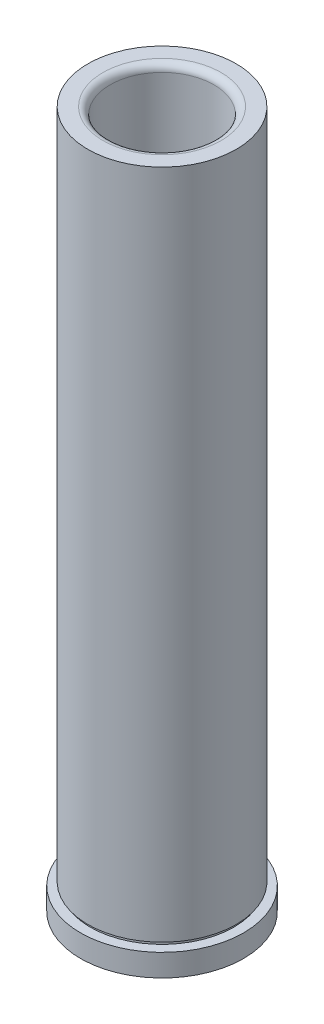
ISO-10303-21;
HEADER;
FILE_DESCRIPTION(('STEP AP214'),'2;1');
FILE_NAME('part.step','',(''),(''),'','','');
FILE_SCHEMA(('AUTOMOTIVE_DESIGN { 1 0 10303 214 1 1 1 1 }'));
ENDSEC;
DATA;
#1=APPLICATION_CONTEXT('core data for automotive mechanical design processes');
#2=APPLICATION_PROTOCOL_DEFINITION('international standard','automotive_design',2000,#1);
#3=PRODUCT_CONTEXT('',#1,'mechanical');
#4=PRODUCT('Part','Part','',(#3));
#5=PRODUCT_RELATED_PRODUCT_CATEGORY('part','',(#4));
#6=PRODUCT_DEFINITION_FORMATION('','',#4);
#7=PRODUCT_DEFINITION_CONTEXT('part definition',#1,'design');
#8=PRODUCT_DEFINITION('design','',#6,#7);
#9=PRODUCT_DEFINITION_SHAPE('','',#8);
#10=(LENGTH_UNIT() NAMED_UNIT(*) SI_UNIT(.MILLI.,.METRE.));
#11=(NAMED_UNIT(*) PLANE_ANGLE_UNIT() SI_UNIT($,.RADIAN.));
#12=(NAMED_UNIT(*) SI_UNIT($,.STERADIAN.) SOLID_ANGLE_UNIT());
#13=UNCERTAINTY_MEASURE_WITH_UNIT(LENGTH_MEASURE(1.E-05),#10,'distance_accuracy_value','');
#14=(GEOMETRIC_REPRESENTATION_CONTEXT(3) GLOBAL_UNCERTAINTY_ASSIGNED_CONTEXT((#13)) GLOBAL_UNIT_ASSIGNED_CONTEXT((#10,
#11,#12)) REPRESENTATION_CONTEXT('',''));
#15=CARTESIAN_POINT('',(0.,0.,0.));
#16=DIRECTION('',(0.,0.,1.));
#17=DIRECTION('',(1.,0.,0.));
#18=AXIS2_PLACEMENT_3D('',#15,#16,#17);
#19=CARTESIAN_POINT('',(-15.88135,149.225,0.));
#20=DIRECTION('',(0.,-1.,0.));
#21=DIRECTION('',(1.,0.,0.));
#22=AXIS2_PLACEMENT_3D('',#19,#20,#21);
#23=PLANE('',#22);
#24=CARTESIAN_POINT('',(-5.21016604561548E-13,149.225,0.));
#25=DIRECTION('',(0.,-1.,0.));
#26=DIRECTION('',(1.,0.,0.));
#27=AXIS2_PLACEMENT_3D('',#24,#25,#26);
#28=CIRCLE('',#27,12.6428499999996);
#29=CARTESIAN_POINT('',(12.642849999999,149.225,0.));
#30=VERTEX_POINT('',#29);
#31=EDGE_CURVE('E36',#30,#30,#28,.T.);
#32=ORIENTED_EDGE('',*,*,#31,.T.);
#33=EDGE_LOOP('',(#32));
#34=FACE_BOUND('',#33,.T.);
#35=CARTESIAN_POINT('',(-5.21016604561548E-13,149.225,0.));
#36=DIRECTION('',(0.,-1.,0.));
#37=DIRECTION('',(1.,0.,0.));
#38=AXIS2_PLACEMENT_3D('',#35,#36,#37);
#39=CIRCLE('',#38,15.8813499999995);
#40=CARTESIAN_POINT('',(15.881349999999,149.225,0.));
#41=VERTEX_POINT('',#40);
#42=EDGE_CURVE('E40',#41,#41,#39,.T.);
#43=ORIENTED_EDGE('',*,*,#42,.F.);
#44=EDGE_LOOP('',(#43));
#45=FACE_BOUND('',#44,.T.);
#46=ADVANCED_FACE('F29',(#34,#45),#23,.F.);
#47=CARTESIAN_POINT('',(3.49148336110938E-12,-1000.,0.));
#48=DIRECTION('',(0.,-1.,0.));
#49=DIRECTION('',(1.,0.,0.));
#50=AXIS2_PLACEMENT_3D('',#47,#48,#49);
#51=CYLINDRICAL_SURFACE('',#50,15.8813499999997);
#52=CARTESIAN_POINT('',(0.,5.52449999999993,0.));
#53=DIRECTION('',(0.,-1.,0.));
#54=DIRECTION('',(1.,0.,0.));
#55=AXIS2_PLACEMENT_3D('',#52,#53,#54);
#56=CIRCLE('',#55,15.88135);
#57=CARTESIAN_POINT('',(15.8813499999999,5.52449999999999,0.));
#58=VERTEX_POINT('',#57);
#59=EDGE_CURVE('E44',#58,#58,#56,.T.);
#60=ORIENTED_EDGE('',*,*,#59,.F.);
#61=EDGE_LOOP('',(#60));
#62=FACE_BOUND('',#61,.T.);
#63=ORIENTED_EDGE('',*,*,#42,.T.);
#64=EDGE_LOOP('',(#63));
#65=FACE_BOUND('',#64,.T.);
#66=ADVANCED_FACE('F121',(#62,#65),#51,.T.);
#67=CARTESIAN_POINT('',(-15.88135,5.5244999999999,0.));
#68=DIRECTION('',(0.,1.,0.));
#69=DIRECTION('',(-1.,0.,0.));
#70=AXIS2_PLACEMENT_3D('',#67,#68,#69);
#71=PLANE('',#70);
#72=CARTESIAN_POINT('',(0.,5.52449999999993,0.));
#73=DIRECTION('',(0.,-1.,0.));
#74=DIRECTION('',(1.,0.,0.));
#75=AXIS2_PLACEMENT_3D('',#72,#73,#74);
#76=CIRCLE('',#75,15.37335);
#77=CARTESIAN_POINT('',(15.3733499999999,5.52449999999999,0.));
#78=VERTEX_POINT('',#77);
#79=EDGE_CURVE('E49',#78,#78,#76,.T.);
#80=ORIENTED_EDGE('',*,*,#79,.F.);
#81=EDGE_LOOP('',(#80));
#82=FACE_BOUND('',#81,.T.);
#83=ORIENTED_EDGE('',*,*,#59,.T.);
#84=EDGE_LOOP('',(#83));
#85=FACE_BOUND('',#84,.T.);
#86=ADVANCED_FACE('F115',(#82,#85),#71,.F.);
#87=CARTESIAN_POINT('',(3.49148336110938E-12,-1000.,0.));
#88=DIRECTION('',(0.,-1.,0.));
#89=DIRECTION('',(1.,0.,0.));
#90=AXIS2_PLACEMENT_3D('',#87,#88,#89);
#91=CYLINDRICAL_SURFACE('',#90,15.37335);
#92=CARTESIAN_POINT('',(0.,4.7625,0.));
#93=DIRECTION('',(0.,-1.,0.));
#94=DIRECTION('',(1.,0.,0.));
#95=AXIS2_PLACEMENT_3D('',#92,#93,#94);
#96=CIRCLE('',#95,15.37335);
#97=CARTESIAN_POINT('',(15.3733499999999,4.76250000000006,0.));
#98=VERTEX_POINT('',#97);
#99=EDGE_CURVE('E52',#98,#98,#96,.T.);
#100=ORIENTED_EDGE('',*,*,#99,.F.);
#101=EDGE_LOOP('',(#100));
#102=FACE_BOUND('',#101,.T.);
#103=ORIENTED_EDGE('',*,*,#79,.T.);
#104=EDGE_LOOP('',(#103));
#105=FACE_BOUND('',#104,.T.);
#106=ADVANCED_FACE('F109',(#102,#105),#91,.T.);
#107=CARTESIAN_POINT('',(-17.4625,4.7624999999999,0.));
#108=DIRECTION('',(0.,-1.,0.));
#109=DIRECTION('',(1.,0.,0.));
#110=AXIS2_PLACEMENT_3D('',#107,#108,#109);
#111=PLANE('',#110);
#112=CARTESIAN_POINT('',(0.,4.7625,0.));
#113=DIRECTION('',(0.,-1.,0.));
#114=DIRECTION('',(1.,0.,0.));
#115=AXIS2_PLACEMENT_3D('',#112,#113,#114);
#116=CIRCLE('',#115,17.4625);
#117=CARTESIAN_POINT('',(17.4625,4.76250000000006,0.));
#118=VERTEX_POINT('',#117);
#119=EDGE_CURVE('E55',#118,#118,#116,.T.);
#120=ORIENTED_EDGE('',*,*,#119,.F.);
#121=EDGE_LOOP('',(#120));
#122=FACE_BOUND('',#121,.T.);
#123=ORIENTED_EDGE('',*,*,#99,.T.);
#124=EDGE_LOOP('',(#123));
#125=FACE_BOUND('',#124,.T.);
#126=ADVANCED_FACE('F103',(#122,#125),#111,.F.);
#127=CARTESIAN_POINT('',(3.49148336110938E-12,-1000.,0.));
#128=DIRECTION('',(0.,-1.,0.));
#129=DIRECTION('',(1.,0.,0.));
#130=AXIS2_PLACEMENT_3D('',#127,#128,#129);
#131=CYLINDRICAL_SURFACE('',#130,17.4625);
#132=CARTESIAN_POINT('',(0.,0.,0.));
#133=DIRECTION('',(0.,-1.,0.));
#134=DIRECTION('',(1.,0.,0.));
#135=AXIS2_PLACEMENT_3D('',#132,#133,#134);
#136=CIRCLE('',#135,17.4625);
#137=CARTESIAN_POINT('',(17.4625,0.,0.));
#138=VERTEX_POINT('',#137);
#139=EDGE_CURVE('E58',#138,#138,#136,.T.);
#140=ORIENTED_EDGE('',*,*,#139,.F.);
#141=EDGE_LOOP('',(#140));
#142=FACE_BOUND('',#141,.T.);
#143=ORIENTED_EDGE('',*,*,#119,.T.);
#144=EDGE_LOOP('',(#143));
#145=FACE_BOUND('',#144,.T.);
#146=ADVANCED_FACE('F97',(#142,#145),#131,.T.);
#147=CARTESIAN_POINT('',(-13.1826,0.,0.));
#148=DIRECTION('',(0.,1.,0.));
#149=DIRECTION('',(-1.,0.,0.));
#150=AXIS2_PLACEMENT_3D('',#147,#148,#149);
#151=PLANE('',#150);
#152=CARTESIAN_POINT('',(0.,0.,0.));
#153=DIRECTION('',(0.,-1.,0.));
#154=DIRECTION('',(1.,0.,0.));
#155=AXIS2_PLACEMENT_3D('',#152,#153,#154);
#156=CIRCLE('',#155,13.1826);
#157=CARTESIAN_POINT('',(13.1826,0.,0.));
#158=VERTEX_POINT('',#157);
#159=EDGE_CURVE('E61',#158,#158,#156,.T.);
#160=ORIENTED_EDGE('',*,*,#159,.F.);
#161=EDGE_LOOP('',(#160));
#162=FACE_BOUND('',#161,.T.);
#163=ORIENTED_EDGE('',*,*,#139,.T.);
#164=EDGE_LOOP('',(#163));
#165=FACE_BOUND('',#164,.T.);
#166=ADVANCED_FACE('F91',(#162,#165),#151,.F.);
#167=CARTESIAN_POINT('',(0.,0.,0.));
#168=DIRECTION('',(0.,-1.,0.));
#169=DIRECTION('',(1.,0.,0.));
#170=AXIS2_PLACEMENT_3D('',#167,#168,#169);
#171=CONICAL_SURFACE('',#170,13.1826,0.78539816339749);
#172=CARTESIAN_POINT('',(0.,0.793749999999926,0.));
#173=DIRECTION('',(0.,-1.,0.));
#174=DIRECTION('',(1.,0.,0.));
#175=AXIS2_PLACEMENT_3D('',#172,#173,#174);
#176=CIRCLE('',#175,12.38885);
#177=CARTESIAN_POINT('',(12.38885,0.79374999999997,0.));
#178=VERTEX_POINT('',#177);
#179=EDGE_CURVE('E64',#178,#178,#176,.T.);
#180=ORIENTED_EDGE('',*,*,#179,.F.);
#181=EDGE_LOOP('',(#180));
#182=FACE_BOUND('',#181,.T.);
#183=ORIENTED_EDGE('',*,*,#159,.T.);
#184=EDGE_LOOP('',(#183));
#185=FACE_BOUND('',#184,.T.);
#186=ADVANCED_FACE('F85',(#182,#185),#171,.F.);
#187=CARTESIAN_POINT('',(3.49148336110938E-12,-1000.,0.));
#188=DIRECTION('',(0.,-1.,0.));
#189=DIRECTION('',(1.,0.,0.));
#190=AXIS2_PLACEMENT_3D('',#187,#188,#189);
#191=CYLINDRICAL_SURFACE('',#190,12.3888499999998);
#192=CARTESIAN_POINT('',(-3.61385985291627E-13,103.505,0.));
#193=DIRECTION('',(0.,-1.,0.));
#194=DIRECTION('',(1.,0.,0.));
#195=AXIS2_PLACEMENT_3D('',#192,#193,#194);
#196=CIRCLE('',#195,12.3888499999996);
#197=CARTESIAN_POINT('',(12.3888499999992,103.505,0.));
#198=VERTEX_POINT('',#197);
#199=EDGE_CURVE('E67',#198,#198,#196,.T.);
#200=ORIENTED_EDGE('',*,*,#199,.F.);
#201=EDGE_LOOP('',(#200));
#202=FACE_BOUND('',#201,.T.);
#203=ORIENTED_EDGE('',*,*,#179,.T.);
#204=EDGE_LOOP('',(#203));
#205=FACE_BOUND('',#204,.T.);
#206=ADVANCED_FACE('F79',(#202,#205),#191,.F.);
#207=CARTESIAN_POINT('',(-3.60822483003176E-13,103.505,0.));
#208=DIRECTION('',(0.,-1.,0.));
#209=DIRECTION('',(1.,0.,0.));
#210=AXIS2_PLACEMENT_3D('',#207,#208,#209);
#211=TOROIDAL_SURFACE('',#210,11.1188499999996,1.26999999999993);
#212=CARTESIAN_POINT('',(-3.65820169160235E-13,104.775,0.));
#213=DIRECTION('',(0.,-1.,0.));
#214=DIRECTION('',(1.,0.,0.));
#215=AXIS2_PLACEMENT_3D('',#212,#213,#214);
#216=CIRCLE('',#215,11.1188499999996);
#217=CARTESIAN_POINT('',(11.1188499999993,104.775,0.));
#218=VERTEX_POINT('',#217);
#219=EDGE_CURVE('E70',#218,#218,#216,.T.);
#220=ORIENTED_EDGE('',*,*,#219,.F.);
#221=EDGE_LOOP('',(#220));
#222=FACE_BOUND('',#221,.T.);
#223=ORIENTED_EDGE('',*,*,#199,.T.);
#224=EDGE_LOOP('',(#223));
#225=FACE_BOUND('',#224,.T.);
#226=ADVANCED_FACE('F76',(#222,#225),#211,.F.);
#227=CARTESIAN_POINT('',(3.49148336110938E-12,-1000.,0.));
#228=DIRECTION('',(0.,-1.,0.));
#229=DIRECTION('',(1.,0.,0.));
#230=AXIS2_PLACEMENT_3D('',#227,#228,#229);
#231=CYLINDRICAL_SURFACE('',#230,11.1188499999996);
#232=CARTESIAN_POINT('',(-5.15695583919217E-13,147.701,0.));
#233=DIRECTION('',(0.,-1.,0.));
#234=DIRECTION('',(1.,0.,0.));
#235=AXIS2_PLACEMENT_3D('',#232,#233,#234);
#236=CIRCLE('',#235,11.1188499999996);
#237=CARTESIAN_POINT('',(11.118849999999,147.701,0.));
#238=VERTEX_POINT('',#237);
#239=EDGE_CURVE('E10',#238,#238,#236,.F.);
#240=ORIENTED_EDGE('',*,*,#239,.T.);
#241=EDGE_LOOP('',(#240));
#242=FACE_BOUND('',#241,.T.);
#243=ORIENTED_EDGE('',*,*,#219,.T.);
#244=EDGE_LOOP('',(#243));
#245=FACE_BOUND('',#244,.T.);
#246=ADVANCED_FACE('F74',(#242,#245),#231,.F.);
#247=CARTESIAN_POINT('',(-5.15695583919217E-13,147.701,0.));
#248=DIRECTION('',(0.,-1.,0.));
#249=DIRECTION('',(1.,0.,0.));
#250=AXIS2_PLACEMENT_3D('',#247,#248,#249);
#251=TOROIDAL_SURFACE('',#250,12.6428499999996,1.524);
#252=ORIENTED_EDGE('',*,*,#239,.F.);
#253=EDGE_LOOP('',(#252));
#254=FACE_BOUND('',#253,.T.);
#255=ORIENTED_EDGE('',*,*,#31,.F.);
#256=EDGE_LOOP('',(#255));
#257=FACE_BOUND('',#256,.T.);
#258=ADVANCED_FACE('F31',(#254,#257),#251,.T.);
#259=CLOSED_SHELL('',(#46,#66,#86,#106,#126,#146,#166,#186,#206,#226,#246,#258));
#260=MANIFOLD_SOLID_BREP('B2',#259);
#261=ADVANCED_BREP_SHAPE_REPRESENTATION('',(#18,#260),#14);
#262=SHAPE_DEFINITION_REPRESENTATION(#9,#261);
ENDSEC;
END-ISO-10303-21;
